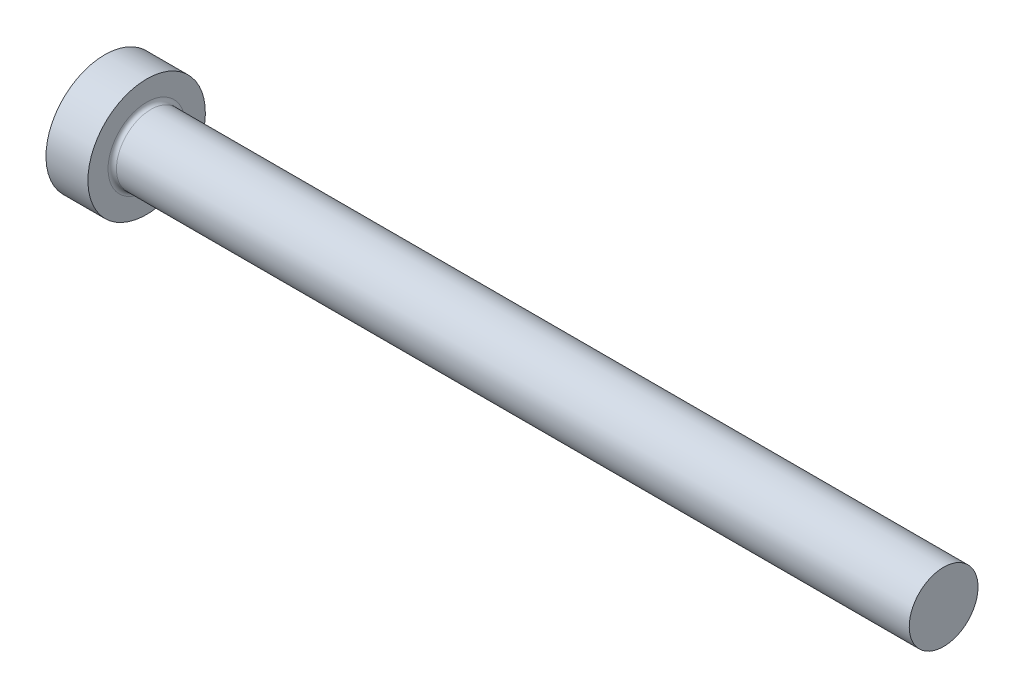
ISO-10303-21;
HEADER;
FILE_DESCRIPTION(('STEP AP214'),'2;1');
FILE_NAME('part.step','',(''),(''),'','','');
FILE_SCHEMA(('AUTOMOTIVE_DESIGN { 1 0 10303 214 1 1 1 1 }'));
ENDSEC;
DATA;
#1=APPLICATION_CONTEXT('core data for automotive mechanical design processes');
#2=APPLICATION_PROTOCOL_DEFINITION('international standard','automotive_design',2000,#1);
#3=PRODUCT_CONTEXT('',#1,'mechanical');
#4=PRODUCT('Part','Part','',(#3));
#5=PRODUCT_RELATED_PRODUCT_CATEGORY('part','',(#4));
#6=PRODUCT_DEFINITION_FORMATION('','',#4);
#7=PRODUCT_DEFINITION_CONTEXT('part definition',#1,'design');
#8=PRODUCT_DEFINITION('design','',#6,#7);
#9=PRODUCT_DEFINITION_SHAPE('','',#8);
#10=(LENGTH_UNIT() NAMED_UNIT(*) SI_UNIT(.MILLI.,.METRE.));
#11=(NAMED_UNIT(*) PLANE_ANGLE_UNIT() SI_UNIT($,.RADIAN.));
#12=(NAMED_UNIT(*) SI_UNIT($,.STERADIAN.) SOLID_ANGLE_UNIT());
#13=UNCERTAINTY_MEASURE_WITH_UNIT(LENGTH_MEASURE(1.E-05),#10,'distance_accuracy_value','');
#14=(GEOMETRIC_REPRESENTATION_CONTEXT(3) GLOBAL_UNCERTAINTY_ASSIGNED_CONTEXT((#13)) GLOBAL_UNIT_ASSIGNED_CONTEXT((#10,
#11,#12)) REPRESENTATION_CONTEXT('',''));
#15=CARTESIAN_POINT('',(0.,0.,0.));
#16=DIRECTION('',(0.,0.,1.));
#17=DIRECTION('',(1.,0.,0.));
#18=AXIS2_PLACEMENT_3D('',#15,#16,#17);
#19=CARTESIAN_POINT('',(0.,0.,0.));
#20=DIRECTION('',(-1.,0.,0.));
#21=DIRECTION('',(0.,-1.,0.));
#22=AXIS2_PLACEMENT_3D('',#19,#20,#21);
#23=PLANE('',#22);
#24=CARTESIAN_POINT('',(0.,0.,0.));
#25=DIRECTION('',(1.,0.,0.));
#26=DIRECTION('',(0.,1.,0.));
#27=AXIS2_PLACEMENT_3D('',#24,#25,#26);
#28=CIRCLE('',#27,7.);
#29=CARTESIAN_POINT('',(0.,7.,0.));
#30=VERTEX_POINT('',#29);
#31=EDGE_CURVE('E25',#30,#30,#28,.T.);
#32=ORIENTED_EDGE('',*,*,#31,.F.);
#33=EDGE_LOOP('',(#32));
#34=FACE_BOUND('',#33,.T.);
#35=ADVANCED_FACE('F14',(#34),#23,.T.);
#36=CARTESIAN_POINT('',(100.,0.,0.));
#37=DIRECTION('',(1.,0.,0.));
#38=DIRECTION('',(0.,1.,0.));
#39=AXIS2_PLACEMENT_3D('',#36,#37,#38);
#40=CYLINDRICAL_SURFACE('',#39,7.);
#41=ORIENTED_EDGE('',*,*,#31,.T.);
#42=EDGE_LOOP('',(#41));
#43=FACE_BOUND('',#42,.T.);
#44=CARTESIAN_POINT('',(5.,0.,0.));
#45=DIRECTION('',(1.,0.,0.));
#46=DIRECTION('',(0.,1.,0.));
#47=AXIS2_PLACEMENT_3D('',#44,#45,#46);
#48=CIRCLE('',#47,7.);
#49=CARTESIAN_POINT('',(5.,7.,0.));
#50=VERTEX_POINT('',#49);
#51=EDGE_CURVE('E29',#50,#50,#48,.T.);
#52=ORIENTED_EDGE('',*,*,#51,.F.);
#53=EDGE_LOOP('',(#52));
#54=FACE_BOUND('',#53,.T.);
#55=ADVANCED_FACE('F51',(#43,#54),#40,.T.);
#56=CARTESIAN_POINT('',(5.,7.,0.));
#57=DIRECTION('',(1.,0.,0.));
#58=DIRECTION('',(0.,1.,0.));
#59=AXIS2_PLACEMENT_3D('',#56,#57,#58);
#60=PLANE('',#59);
#61=CARTESIAN_POINT('',(5.,0.,0.));
#62=DIRECTION('',(1.,0.,0.));
#63=DIRECTION('',(0.,1.,0.));
#64=AXIS2_PLACEMENT_3D('',#61,#62,#63);
#65=CIRCLE('',#64,4.6);
#66=CARTESIAN_POINT('',(5.,4.6,0.));
#67=VERTEX_POINT('',#66);
#68=EDGE_CURVE('E9',#67,#67,#65,.F.);
#69=ORIENTED_EDGE('',*,*,#68,.T.);
#70=EDGE_LOOP('',(#69));
#71=FACE_BOUND('',#70,.T.);
#72=ORIENTED_EDGE('',*,*,#51,.T.);
#73=EDGE_LOOP('',(#72));
#74=FACE_BOUND('',#73,.T.);
#75=ADVANCED_FACE('F42',(#71,#74),#60,.T.);
#76=CARTESIAN_POINT('',(100.,0.,0.));
#77=DIRECTION('',(1.,0.,0.));
#78=DIRECTION('',(0.,1.,0.));
#79=AXIS2_PLACEMENT_3D('',#76,#77,#78);
#80=CYLINDRICAL_SURFACE('',#79,4.1);
#81=CARTESIAN_POINT('',(5.5,0.,0.));
#82=DIRECTION('',(1.,0.,0.));
#83=DIRECTION('',(0.,1.,0.));
#84=AXIS2_PLACEMENT_3D('',#81,#82,#83);
#85=CIRCLE('',#84,4.1);
#86=CARTESIAN_POINT('',(5.5,4.1,0.));
#87=VERTEX_POINT('',#86);
#88=EDGE_CURVE('E21',#87,#87,#85,.T.);
#89=ORIENTED_EDGE('',*,*,#88,.T.);
#90=EDGE_LOOP('',(#89));
#91=FACE_BOUND('',#90,.T.);
#92=CARTESIAN_POINT('',(100.,0.,0.));
#93=DIRECTION('',(1.,0.,0.));
#94=DIRECTION('',(0.,1.,0.));
#95=AXIS2_PLACEMENT_3D('',#92,#93,#94);
#96=CIRCLE('',#95,4.1);
#97=CARTESIAN_POINT('',(100.,4.09999999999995,0.));
#98=VERTEX_POINT('',#97);
#99=EDGE_CURVE('E34',#98,#98,#96,.T.);
#100=ORIENTED_EDGE('',*,*,#99,.F.);
#101=EDGE_LOOP('',(#100));
#102=FACE_BOUND('',#101,.T.);
#103=ADVANCED_FACE('F40',(#91,#102),#80,.T.);
#104=CARTESIAN_POINT('',(100.,4.09999999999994,0.));
#105=DIRECTION('',(1.,0.,0.));
#106=DIRECTION('',(0.,1.,0.));
#107=AXIS2_PLACEMENT_3D('',#104,#105,#106);
#108=PLANE('',#107);
#109=ORIENTED_EDGE('',*,*,#99,.T.);
#110=EDGE_LOOP('',(#109));
#111=FACE_BOUND('',#110,.T.);
#112=ADVANCED_FACE('F38',(#111),#108,.T.);
#113=CARTESIAN_POINT('',(5.5,0.,0.));
#114=DIRECTION('',(1.,0.,0.));
#115=DIRECTION('',(0.,1.,0.));
#116=AXIS2_PLACEMENT_3D('',#113,#114,#115);
#117=TOROIDAL_SURFACE('',#116,4.6,0.5);
#118=ORIENTED_EDGE('',*,*,#68,.F.);
#119=EDGE_LOOP('',(#118));
#120=FACE_BOUND('',#119,.T.);
#121=ORIENTED_EDGE('',*,*,#88,.F.);
#122=EDGE_LOOP('',(#121));
#123=FACE_BOUND('',#122,.T.);
#124=ADVANCED_FACE('F16',(#120,#123),#117,.F.);
#125=CLOSED_SHELL('',(#35,#55,#75,#103,#112,#124));
#126=MANIFOLD_SOLID_BREP('B1',#125);
#127=ADVANCED_BREP_SHAPE_REPRESENTATION('',(#18,#126),#14);
#128=SHAPE_DEFINITION_REPRESENTATION(#9,#127);
ENDSEC;
END-ISO-10303-21;
